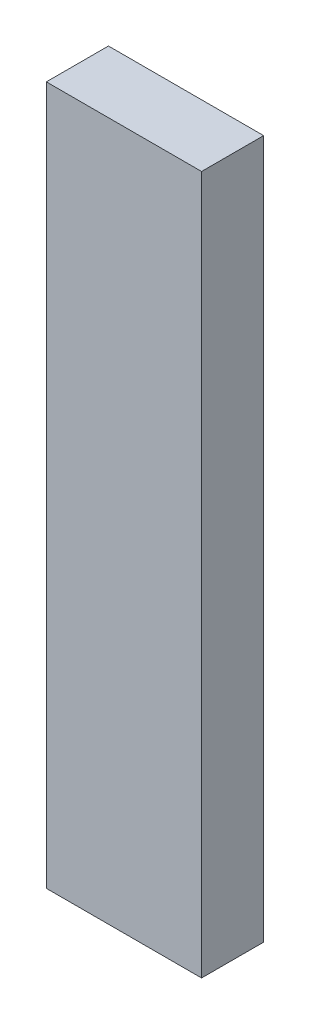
ISO-10303-21;
HEADER;
FILE_DESCRIPTION(('STEP AP214'),'2;1');
FILE_NAME('part.step','',(''),(''),'','','');
FILE_SCHEMA(('AUTOMOTIVE_DESIGN { 1 0 10303 214 1 1 1 1 }'));
ENDSEC;
DATA;
#1=APPLICATION_CONTEXT('core data for automotive mechanical design processes');
#2=APPLICATION_PROTOCOL_DEFINITION('international standard','automotive_design',2000,#1);
#3=PRODUCT_CONTEXT('',#1,'mechanical');
#4=PRODUCT('Part','Part','',(#3));
#5=PRODUCT_RELATED_PRODUCT_CATEGORY('part','',(#4));
#6=PRODUCT_DEFINITION_FORMATION('','',#4);
#7=PRODUCT_DEFINITION_CONTEXT('part definition',#1,'design');
#8=PRODUCT_DEFINITION('design','',#6,#7);
#9=PRODUCT_DEFINITION_SHAPE('','',#8);
#10=(LENGTH_UNIT() NAMED_UNIT(*) SI_UNIT(.MILLI.,.METRE.));
#11=(NAMED_UNIT(*) PLANE_ANGLE_UNIT() SI_UNIT($,.RADIAN.));
#12=(NAMED_UNIT(*) SI_UNIT($,.STERADIAN.) SOLID_ANGLE_UNIT());
#13=UNCERTAINTY_MEASURE_WITH_UNIT(LENGTH_MEASURE(1.E-05),#10,'distance_accuracy_value','');
#14=(GEOMETRIC_REPRESENTATION_CONTEXT(3) GLOBAL_UNCERTAINTY_ASSIGNED_CONTEXT((#13)) GLOBAL_UNIT_ASSIGNED_CONTEXT((#10,
#11,#12)) REPRESENTATION_CONTEXT('',''));
#15=CARTESIAN_POINT('',(0.,0.,0.));
#16=DIRECTION('',(0.,0.,1.));
#17=DIRECTION('',(1.,0.,0.));
#18=AXIS2_PLACEMENT_3D('',#15,#16,#17);
#19=CARTESIAN_POINT('',(0.,0.,8.));
#20=DIRECTION('',(1.,0.,0.));
#21=DIRECTION('',(0.,0.,-1.));
#22=AXIS2_PLACEMENT_3D('',#19,#20,#21);
#23=PLANE('',#22);
#24=DIRECTION('',(0.,-1.,0.));
#25=VECTOR('',#24,1.);
#26=CARTESIAN_POINT('',(0.,0.,0.));
#27=LINE('',#26,#25);
#28=CARTESIAN_POINT('',(0.,90.,0.));
#29=VERTEX_POINT('',#28);
#30=CARTESIAN_POINT('',(0.,0.,0.));
#31=VERTEX_POINT('',#30);
#32=EDGE_CURVE('E94',#29,#31,#27,.T.);
#33=ORIENTED_EDGE('',*,*,#32,.T.);
#34=DIRECTION('',(0.,0.,-1.));
#35=VECTOR('',#34,1.);
#36=CARTESIAN_POINT('',(0.,0.,8.));
#37=LINE('',#36,#35);
#38=CARTESIAN_POINT('',(0.,0.,8.));
#39=VERTEX_POINT('',#38);
#40=EDGE_CURVE('E11',#39,#31,#37,.T.);
#41=ORIENTED_EDGE('',*,*,#40,.F.);
#42=DIRECTION('',(0.,-1.,0.));
#43=VECTOR('',#42,1.);
#44=CARTESIAN_POINT('',(0.,0.,8.));
#45=LINE('',#44,#43);
#46=CARTESIAN_POINT('',(0.,90.,8.));
#47=VERTEX_POINT('',#46);
#48=EDGE_CURVE('E82',#47,#39,#45,.T.);
#49=ORIENTED_EDGE('',*,*,#48,.F.);
#50=DIRECTION('',(0.,0.,-1.));
#51=VECTOR('',#50,1.);
#52=CARTESIAN_POINT('',(0.,90.,8.));
#53=LINE('',#52,#51);
#54=EDGE_CURVE('E90',#47,#29,#53,.T.);
#55=ORIENTED_EDGE('',*,*,#54,.T.);
#56=EDGE_LOOP('',(#33,#41,#49,#55));
#57=FACE_BOUND('',#56,.T.);
#58=ADVANCED_FACE('F31',(#57),#23,.F.);
#59=CARTESIAN_POINT('',(0.,0.,8.));
#60=DIRECTION('',(0.,1.,0.));
#61=DIRECTION('',(0.,0.,1.));
#62=AXIS2_PLACEMENT_3D('',#59,#60,#61);
#63=PLANE('',#62);
#64=DIRECTION('',(1.,0.,0.));
#65=VECTOR('',#64,1.);
#66=CARTESIAN_POINT('',(0.,0.,0.));
#67=LINE('',#66,#65);
#68=CARTESIAN_POINT('',(20.,0.,0.));
#69=VERTEX_POINT('',#68);
#70=EDGE_CURVE('E86',#31,#69,#67,.T.);
#71=ORIENTED_EDGE('',*,*,#70,.T.);
#72=DIRECTION('',(0.,0.,-1.));
#73=VECTOR('',#72,1.);
#74=CARTESIAN_POINT('',(20.,0.,8.));
#75=LINE('',#74,#73);
#76=CARTESIAN_POINT('',(20.,0.,8.));
#77=VERTEX_POINT('',#76);
#78=EDGE_CURVE('E39',#77,#69,#75,.T.);
#79=ORIENTED_EDGE('',*,*,#78,.F.);
#80=DIRECTION('',(1.,0.,0.));
#81=VECTOR('',#80,1.);
#82=CARTESIAN_POINT('',(0.,0.,8.));
#83=LINE('',#82,#81);
#84=EDGE_CURVE('E77',#39,#77,#83,.T.);
#85=ORIENTED_EDGE('',*,*,#84,.F.);
#86=ORIENTED_EDGE('',*,*,#40,.T.);
#87=EDGE_LOOP('',(#71,#79,#85,#86));
#88=FACE_BOUND('',#87,.T.);
#89=ADVANCED_FACE('F85',(#88),#63,.F.);
#90=CARTESIAN_POINT('',(20.,0.,8.));
#91=DIRECTION('',(-1.,0.,0.));
#92=DIRECTION('',(0.,0.,1.));
#93=AXIS2_PLACEMENT_3D('',#90,#91,#92);
#94=PLANE('',#93);
#95=DIRECTION('',(0.,1.,0.));
#96=VECTOR('',#95,1.);
#97=CARTESIAN_POINT('',(20.,0.,0.));
#98=LINE('',#97,#96);
#99=CARTESIAN_POINT('',(20.,90.,0.));
#100=VERTEX_POINT('',#99);
#101=EDGE_CURVE('E64',#69,#100,#98,.T.);
#102=ORIENTED_EDGE('',*,*,#101,.T.);
#103=DIRECTION('',(0.,0.,-1.));
#104=VECTOR('',#103,1.);
#105=CARTESIAN_POINT('',(20.,90.,8.));
#106=LINE('',#105,#104);
#107=CARTESIAN_POINT('',(20.,90.,8.));
#108=VERTEX_POINT('',#107);
#109=EDGE_CURVE('E87',#108,#100,#106,.T.);
#110=ORIENTED_EDGE('',*,*,#109,.F.);
#111=DIRECTION('',(0.,1.,0.));
#112=VECTOR('',#111,1.);
#113=CARTESIAN_POINT('',(20.,0.,8.));
#114=LINE('',#113,#112);
#115=EDGE_CURVE('E80',#77,#108,#114,.T.);
#116=ORIENTED_EDGE('',*,*,#115,.F.);
#117=ORIENTED_EDGE('',*,*,#78,.T.);
#118=EDGE_LOOP('',(#102,#110,#116,#117));
#119=FACE_BOUND('',#118,.T.);
#120=ADVANCED_FACE('F88',(#119),#94,.F.);
#121=CARTESIAN_POINT('',(0.,90.,8.));
#122=DIRECTION('',(0.,-1.,0.));
#123=DIRECTION('',(0.,0.,-1.));
#124=AXIS2_PLACEMENT_3D('',#121,#122,#123);
#125=PLANE('',#124);
#126=DIRECTION('',(-1.,0.,0.));
#127=VECTOR('',#126,1.);
#128=CARTESIAN_POINT('',(0.,90.,0.));
#129=LINE('',#128,#127);
#130=EDGE_CURVE('E70',#100,#29,#129,.T.);
#131=ORIENTED_EDGE('',*,*,#130,.T.);
#132=ORIENTED_EDGE('',*,*,#54,.F.);
#133=DIRECTION('',(-1.,0.,0.));
#134=VECTOR('',#133,1.);
#135=CARTESIAN_POINT('',(0.,90.,8.));
#136=LINE('',#135,#134);
#137=EDGE_CURVE('E47',#108,#47,#136,.T.);
#138=ORIENTED_EDGE('',*,*,#137,.F.);
#139=ORIENTED_EDGE('',*,*,#109,.T.);
#140=EDGE_LOOP('',(#131,#132,#138,#139));
#141=FACE_BOUND('',#140,.T.);
#142=ADVANCED_FACE('F101',(#141),#125,.F.);
#143=CARTESIAN_POINT('',(0.,90.,8.));
#144=DIRECTION('',(0.,0.,-1.));
#145=DIRECTION('',(-1.,0.,0.));
#146=AXIS2_PLACEMENT_3D('',#143,#144,#145);
#147=PLANE('',#146);
#148=ORIENTED_EDGE('',*,*,#48,.T.);
#149=ORIENTED_EDGE('',*,*,#84,.T.);
#150=ORIENTED_EDGE('',*,*,#115,.T.);
#151=ORIENTED_EDGE('',*,*,#137,.T.);
#152=EDGE_LOOP('',(#148,#149,#150,#151));
#153=FACE_BOUND('',#152,.T.);
#154=ADVANCED_FACE('F78',(#153),#147,.F.);
#155=CARTESIAN_POINT('',(0.,90.,0.));
#156=DIRECTION('',(0.,0.,-1.));
#157=DIRECTION('',(-1.,0.,0.));
#158=AXIS2_PLACEMENT_3D('',#155,#156,#157);
#159=PLANE('',#158);
#160=ORIENTED_EDGE('',*,*,#32,.F.);
#161=ORIENTED_EDGE('',*,*,#130,.F.);
#162=ORIENTED_EDGE('',*,*,#101,.F.);
#163=ORIENTED_EDGE('',*,*,#70,.F.);
#164=EDGE_LOOP('',(#160,#161,#162,#163));
#165=FACE_BOUND('',#164,.T.);
#166=ADVANCED_FACE('F104',(#165),#159,.T.);
#167=CLOSED_SHELL('',(#58,#89,#120,#142,#154,#166));
#168=MANIFOLD_SOLID_BREP('B2',#167);
#169=ADVANCED_BREP_SHAPE_REPRESENTATION('',(#18,#168),#14);
#170=SHAPE_DEFINITION_REPRESENTATION(#9,#169);
ENDSEC;
END-ISO-10303-21;
